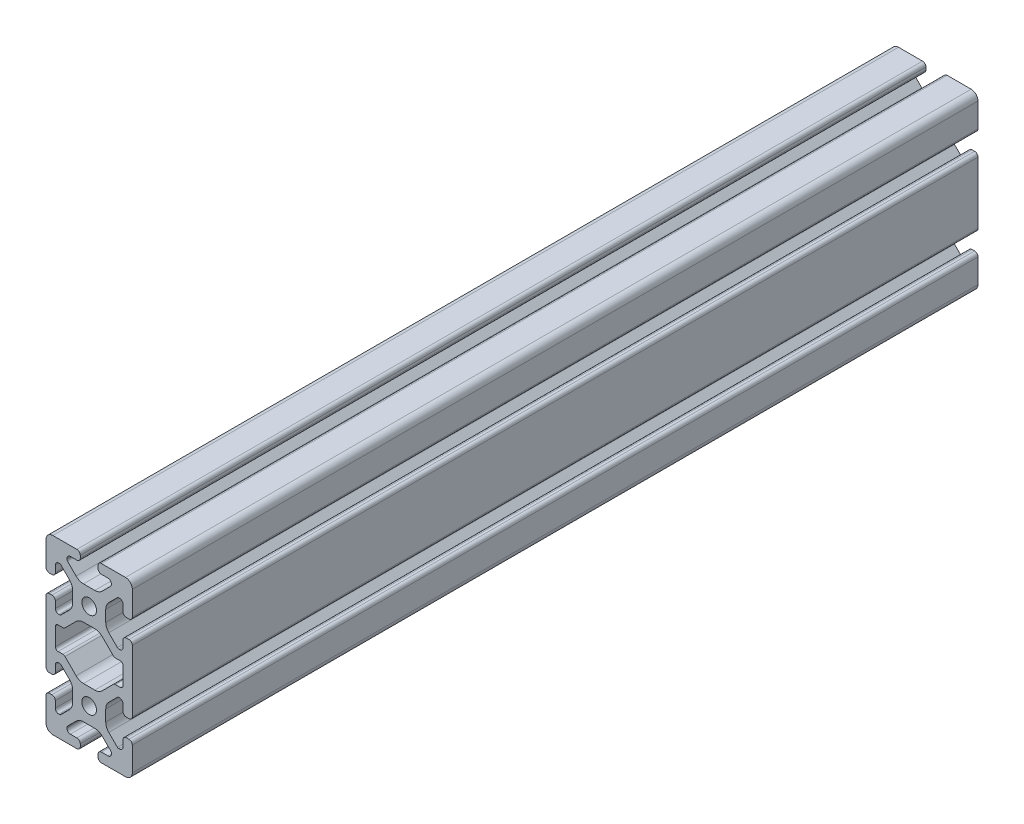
from build123d import *

# Parameters (mm, degrees)
SKETCH1_R           = 3.405
BOSS_EXTRUDE1_DEPTH = 3048
SKETCH26_W          = 40
SKETCH26_H          = 80.80011746
CUT_EXTRUDE1_DEPTH  = 2287.874723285
SKETCH33_W          = 40
SKETCH33_H          = 80.80011746
CUT_EXTRUDE2_DEPTH  = 1526.311771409
SKETCH41_W          = 40
SKETCH41_H          = 80.80011746
CUT_EXTRUDE3_DEPTH  = 1116.83781704
SKETCH50_W          = 40
SKETCH50_H          = 80.80011746
CUT_EXTRUDE4_DEPTH  = 787.391388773
SKETCH51_W          = 40
SKETCH51_H          = 80.80011746
CUT_EXTRUDE5_DEPTH  = 397.992259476


with BuildPart() as part:
    # Sketch1 → Boss-Extrude1 (new body)
    with BuildSketch(Plane(origin=(0, 0, -3048), x_dir=(-1, 0, 0), z_dir=(0, 0, -1))):
        with BuildLine():
            Line((16.83, 60), (5.69044933, 60))
            ThreePointArc((5.69044933, 60), (4.580291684, 59.540157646), (4.12044933, 58.43))
            Line((4.12044933, 58.43), (4.12044933, 57.25))
            ThreePointArc((4.12044933, 57.25), (4.580291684, 56.139842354), (5.69044933, 55.68))
            Line((5.69044933, 55.68), (8.7153995, 55.68))
            ThreePointArc((8.7153995, 55.68), (9.825557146, 55.220157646), (10.2853995, 54.11))
            Line((10.2853995, 54.11), (10.2853995, 53.654903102))
            ThreePointArc((10.2853995, 53.654903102), (10.227547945, 53.364063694), (10.062800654, 53.117501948))
            Line((10.062800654, 53.117501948), (6.055092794, 49.109794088))
            ThreePointArc((6.055092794, 49.109794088), (4.47691877, 48.055291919), (2.615335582, 47.685))
            Line((2.615335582, 47.685), (-2.615335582, 47.685))
            ThreePointArc((-2.615335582, 47.685), (-4.47691877, 48.055291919), (-6.055092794, 49.109794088))
            Line((-6.055092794, 49.109794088), (-10.062800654, 53.117501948))
            ThreePointArc((-10.062800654, 53.117501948), (-10.227547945, 53.364063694), (-10.2853995, 53.654903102))
            Line((-10.2853995, 53.654903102), (-10.2853995, 54.11))
            ThreePointArc((-10.2853995, 54.11), (-9.825557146, 55.220157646), (-8.7153995, 55.68))
            Line((-8.7153995, 55.68), (-5.69044933, 55.68))
            ThreePointArc((-5.69044933, 55.68), (-4.580291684, 56.139842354), (-4.12044933, 57.25))
            Line((-4.12044933, 57.25), (-4.12044933, 58.43))
            ThreePointArc((-4.12044933, 58.43), (-4.580291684, 59.540157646), (-5.69044933, 60))
            Line((-5.69044933, 60), (-16.83, 60))
            ThreePointArc((-16.83, 60), (-19.071528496, 59.071528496), (-20, 56.83))
            Line((-20, 56.83), (-20, 45.69044933))
            ThreePointArc((-20, 45.69044933), (-19.540157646, 44.580291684), (-18.43, 44.12044933))
            Line((-18.43, 44.12044933), (-17.25, 44.12044933))
            ThreePointArc((-17.25, 44.12044933), (-16.139842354, 44.580291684), (-15.68, 45.69044933))
            Line((-15.68, 45.69044933), (-15.68, 48.7153995))
            ThreePointArc((-15.68, 48.7153995), (-15.220157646, 49.825557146), (-14.11, 50.2853995))
            Line((-14.11, 50.2853995), (-13.652670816, 50.2853995))
            ThreePointArc((-13.652670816, 50.2853995), (-13.361831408, 50.227547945), (-13.115269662, 50.062800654))
            Line((-13.115269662, 50.062800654), (-9.109794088, 46.05732508))
            ThreePointArc((-9.109794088, 46.05732508), (-8.055291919, 44.479151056), (-7.685, 42.617567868))
            Line((-7.685, 42.617567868), (-7.685, 37.384664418))
            ThreePointArc((-7.685, 37.384664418), (-8.055291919, 35.52308123), (-9.109794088, 33.944907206))
            Line((-9.109794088, 33.944907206), (-13.117501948, 29.937199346))
            ThreePointArc((-13.117501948, 29.937199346), (-13.364063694, 29.772452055), (-13.654903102, 29.7146005))
            Line((-13.654903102, 29.7146005), (-14.11, 29.7146005))
            ThreePointArc((-14.11, 29.7146005), (-15.220157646, 30.174442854), (-15.68, 31.2846005))
            Line((-15.68, 31.2846005), (-15.68, 34.30955067))
            ThreePointArc((-15.68, 34.30955067), (-16.139842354, 35.419708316), (-17.25, 35.87955067))
            Line((-17.25, 35.87955067), (-18.43, 35.87955067))
            ThreePointArc((-18.43, 35.87955067), (-19.540157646, 35.419708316), (-20, 34.30955067))
            Line((-20, 34.30955067), (-20, 5.69044933))
            ThreePointArc((-20, 5.69044933), (-19.540157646, 4.580291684), (-18.43, 4.12044933))
            Line((-18.43, 4.12044933), (-17.25, 4.12044933))
            ThreePointArc((-17.25, 4.12044933), (-16.139842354, 4.580291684), (-15.68, 5.69044933))
            Line((-15.68, 5.69044933), (-15.68, 8.7153995))
            ThreePointArc((-15.68, 8.7153995), (-15.220157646, 9.825557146), (-14.11, 10.2853995))
            Line((-14.11, 10.2853995), (-13.654903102, 10.2853995))
            ThreePointArc((-13.654903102, 10.2853995), (-13.364063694, 10.227547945), (-13.117501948, 10.062800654))
            Line((-13.117501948, 10.062800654), (-9.109794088, 6.055092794))
            ThreePointArc((-9.109794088, 6.055092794), (-8.055291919, 4.47691877), (-7.685, 2.615335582))
            Line((-7.685, 2.615335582), (-7.685, -2.615335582))
            ThreePointArc((-7.685, -2.615335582), (-8.055291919, -4.47691877), (-9.109794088, -6.055092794))
            Line((-9.109794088, -6.055092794), (-13.117501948, -10.062800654))
            ThreePointArc((-13.117501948, -10.062800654), (-13.364063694, -10.227547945), (-13.654903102, -10.2853995))
            Line((-13.654903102, -10.2853995), (-14.11, -10.2853995))
            ThreePointArc((-14.11, -10.2853995), (-15.220157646, -9.825557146), (-15.68, -8.7153995))
            Line((-15.68, -8.7153995), (-15.68, -5.69044933))
            ThreePointArc((-15.68, -5.69044933), (-16.139842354, -4.580291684), (-17.25, -4.12044933))
            Line((-17.25, -4.12044933), (-18.43, -4.12044933))
            ThreePointArc((-18.43, -4.12044933), (-19.540157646, -4.580291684), (-20, -5.69044933))
            Line((-20, -5.69044933), (-20, -16.83))
            ThreePointArc((-20, -16.83), (-19.071528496, -19.071528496), (-16.83, -20))
            Line((-16.83, -20), (-5.69044933, -20))
            ThreePointArc((-5.69044933, -20), (-4.580291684, -19.540157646), (-4.12044933, -18.43))
            Line((-4.12044933, -18.43), (-4.12044933, -17.25))
            ThreePointArc((-4.12044933, -17.25), (-4.580291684, -16.139842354), (-5.69044933, -15.68))
            Line((-5.69044933, -15.68), (-8.7153995, -15.68))
            ThreePointArc((-8.7153995, -15.68), (-9.825557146, -15.220157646), (-10.2853995, -14.11))
            Line((-10.2853995, -14.11), (-10.2853995, -13.654903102))
            ThreePointArc((-10.2853995, -13.654903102), (-10.227547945, -13.364063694), (-10.062800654, -13.117501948))
            Line((-10.062800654, -13.117501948), (-6.055092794, -9.109794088))
            ThreePointArc((-6.055092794, -9.109794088), (-4.47691877, -8.055291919), (-2.615335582, -7.685))
            Line((-2.615335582, -7.685), (2.615335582, -7.685))
            ThreePointArc((2.615335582, -7.685), (4.47691877, -8.055291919), (6.055092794, -9.109794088))
            Line((6.055092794, -9.109794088), (10.062800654, -13.117501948))
            ThreePointArc((10.062800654, -13.117501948), (10.227547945, -13.364063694), (10.2853995, -13.654903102))
            Line((10.2853995, -13.654903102), (10.2853995, -14.11))
            ThreePointArc((10.2853995, -14.11), (9.825557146, -15.220157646), (8.7153995, -15.68))
            Line((8.7153995, -15.68), (5.69044933, -15.68))
            ThreePointArc((5.69044933, -15.68), (4.580291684, -16.139842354), (4.12044933, -17.25))
            Line((4.12044933, -17.25), (4.12044933, -18.43))
            ThreePointArc((4.12044933, -18.43), (4.580291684, -19.540157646), (5.69044933, -20))
            Line((5.69044933, -20), (16.83, -20))
            ThreePointArc((16.83, -20), (19.071528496, -19.071528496), (20, -16.83))
            Line((20, -16.83), (20, -5.69044933))
            ThreePointArc((20, -5.69044933), (19.540157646, -4.580291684), (18.43, -4.12044933))
            Line((18.43, -4.12044933), (17.25, -4.12044933))
            ThreePointArc((17.25, -4.12044933), (16.139842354, -4.580291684), (15.68, -5.69044933))
            Line((15.68, -5.69044933), (15.68, -8.7153995))
            ThreePointArc((15.68, -8.7153995), (15.220157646, -9.825557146), (14.11, -10.2853995))
            Line((14.11, -10.2853995), (13.654903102, -10.2853995))
            ThreePointArc((13.654903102, -10.2853995), (13.364063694, -10.227547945), (13.117501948, -10.062800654))
            Line((13.117501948, -10.062800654), (9.109794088, -6.055092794))
            ThreePointArc((9.109794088, -6.055092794), (8.055291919, -4.47691877), (7.685, -2.615335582))
            Line((7.685, -2.615335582), (7.685, 2.615335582))
            ThreePointArc((7.685, 2.615335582), (8.055291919, 4.47691877), (9.109794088, 6.055092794))
            Line((9.109794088, 6.055092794), (13.117501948, 10.062800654))
            ThreePointArc((13.117501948, 10.062800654), (13.364063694, 10.227547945), (13.654903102, 10.2853995))
            Line((13.654903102, 10.2853995), (14.11, 10.2853995))
            ThreePointArc((14.11, 10.2853995), (15.220157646, 9.825557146), (15.68, 8.7153995))
            Line((15.68, 8.7153995), (15.68, 5.69044933))
            ThreePointArc((15.68, 5.69044933), (16.139842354, 4.580291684), (17.25, 4.12044933))
            Line((17.25, 4.12044933), (18.43, 4.12044933))
            ThreePointArc((18.43, 4.12044933), (19.540157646, 4.580291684), (20, 5.69044933))
            Line((20, 5.69044933), (20, 34.30955067))
            ThreePointArc((20, 34.30955067), (19.540157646, 35.419708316), (18.43, 35.87955067))
            Line((18.43, 35.87955067), (17.25, 35.87955067))
            ThreePointArc((17.25, 35.87955067), (16.139842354, 35.419708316), (15.68, 34.30955067))
            Line((15.68, 34.30955067), (15.68, 31.2846005))
            ThreePointArc((15.68, 31.2846005), (15.220157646, 30.174442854), (14.11, 29.7146005))
            Line((14.11, 29.7146005), (13.654903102, 29.7146005))
            ThreePointArc((13.654903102, 29.7146005), (13.364063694, 29.772452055), (13.117501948, 29.937199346))
            Line((13.117501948, 29.937199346), (9.109794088, 33.944907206))
            ThreePointArc((9.109794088, 33.944907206), (8.055291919, 35.52308123), (7.685, 37.384664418))
            Line((7.685, 37.384664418), (7.685, 42.615335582))
            ThreePointArc((7.685, 42.615335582), (8.055291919, 44.47691877), (9.109794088, 46.055092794))
            Line((9.109794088, 46.055092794), (13.117501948, 50.062800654))
            ThreePointArc((13.117501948, 50.062800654), (13.364063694, 50.227547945), (13.654903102, 50.2853995))
            Line((13.654903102, 50.2853995), (14.11, 50.2853995))
            ThreePointArc((14.11, 50.2853995), (15.220157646, 49.825557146), (15.68, 48.7153995))
            Line((15.68, 48.7153995), (15.68, 45.69044933))
            ThreePointArc((15.68, 45.69044933), (16.139842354, 44.580291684), (17.25, 44.12044933))
            Line((17.25, 44.12044933), (18.43, 44.12044933))
            ThreePointArc((18.43, 44.12044933), (19.540157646, 44.580291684), (20, 45.69044933))
            Line((20, 45.69044933), (20, 56.83))
            ThreePointArc((20, 56.83), (19.071528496, 59.071528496), (16.83, 60))
        make_face()
        with Locations(Location((0, 0, 0), (0, 0, 180))):
            Circle(SKETCH1_R, mode=Mode.SUBTRACT)
        with Locations(Location((0, 40, 0), (0, 0, 180))):
            Circle(SKETCH1_R, mode=Mode.SUBTRACT)
        with BuildLine():
            Line((14.41, 14.65864833), (12.129998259, 14.65864833))
            ThreePointArc((12.129998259, 14.65864833), (11.608780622, 14.546764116), (11.179399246, 14.230824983))
            Line((11.179399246, 14.230824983), (6.055092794, 9.109794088))
            ThreePointArc((6.055092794, 9.109794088), (4.47691877, 8.055291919), (2.615335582, 7.685))
            Line((2.615335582, 7.685), (-2.615335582, 7.685))
            ThreePointArc((-2.615335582, 7.685), (-4.47691877, 8.055291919), (-6.055092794, 9.109794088))
            Line((-6.055092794, 9.109794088), (-11.231972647, 14.286673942))
            ThreePointArc((-11.231972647, 14.286673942), (-11.6439903, 14.561975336), (-12.129998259, 14.65864833))
            Line((-12.129998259, 14.65864833), (-14.41, 14.65864833))
            ThreePointArc((-14.41, 14.65864833), (-15.308025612, 15.030622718), (-15.68, 15.92864833))
            Line((-15.68, 15.92864833), (-15.68, 24.07135167))
            ThreePointArc((-15.68, 24.07135167), (-15.308025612, 24.969377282), (-14.41, 25.34135167))
            Line((-14.41, 25.34135167), (-12.129998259, 25.34135167))
            ThreePointArc((-12.129998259, 25.34135167), (-11.6439903, 25.438024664), (-11.231972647, 25.713326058))
            Line((-11.231972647, 25.713326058), (-6.055092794, 30.890205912))
            ThreePointArc((-6.055092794, 30.890205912), (-4.47691877, 31.944708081), (-2.615335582, 32.315))
            Line((-2.615335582, 32.315), (2.617567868, 32.315))
            ThreePointArc((2.617567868, 32.315), (4.479151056, 31.944708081), (6.05732508, 30.890205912))
            Line((6.05732508, 30.890205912), (11.184160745, 25.763370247))
            ThreePointArc((11.184160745, 25.763370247), (11.612140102, 25.451641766), (12.129998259, 25.34135167))
            Line((12.129998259, 25.34135167), (14.41, 25.34135167))
            ThreePointArc((14.41, 25.34135167), (15.308025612, 24.969377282), (15.68, 24.07135167))
            Line((15.68, 24.07135167), (15.68, 15.92864833))
            ThreePointArc((15.68, 15.92864833), (15.308025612, 15.030622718), (14.41, 14.65864833))
        make_face(mode=Mode.SUBTRACT)
    extrude(amount=-BOSS_EXTRUDE1_DEPTH)

    # Sketch26 → Cut-Extrude1 (cut, through all)
    with BuildSketch(Plane.XY.offset(-762)):
        with Locations((0, 19.59994127)):
            Rectangle(SKETCH26_W, SKETCH26_H)
    extrude(amount=CUT_EXTRUDE1_DEPTH, mode=Mode.SUBTRACT)

    # Sketch33 → Cut-Extrude2 (cut, through all)
    with BuildSketch(Plane.XY.offset(-1524)):
        with Locations((0, 19.59994127)):
            Rectangle(SKETCH33_W, SKETCH33_H)
    extrude(amount=CUT_EXTRUDE2_DEPTH, mode=Mode.SUBTRACT)

    # Sketch41 → Cut-Extrude3 (cut, through all)
    with BuildSketch(Plane.XY.offset(-1933.956)):
        with Locations((0, 19.59994127)):
            Rectangle(SKETCH41_W, SKETCH41_H)
    extrude(amount=CUT_EXTRUDE3_DEPTH, mode=Mode.SUBTRACT)

    # Sketch50 → Cut-Extrude4 (cut, through all)
    with BuildSketch(Plane.XY.offset(-2264.156)):
        with Locations((0, 19.59994127)):
            Rectangle(SKETCH50_W, SKETCH50_H)
    extrude(amount=CUT_EXTRUDE4_DEPTH, mode=Mode.SUBTRACT)

    # Sketch51 → Cut-Extrude5 (cut, through all)
    with BuildSketch(Plane.XY.offset(-2656.078)):
        with Locations((0, 19.59994127)):
            Rectangle(SKETCH51_W, SKETCH51_H)
    extrude(amount=-CUT_EXTRUDE5_DEPTH, mode=Mode.SUBTRACT)


solid = part.part
